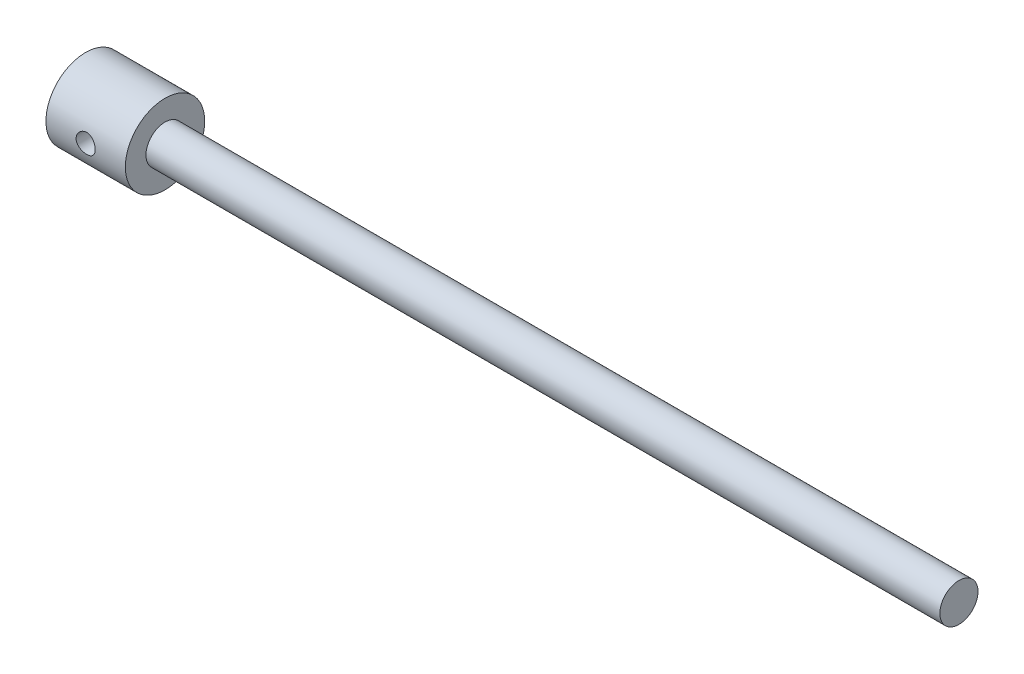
ISO-10303-21;
HEADER;
FILE_DESCRIPTION(('STEP AP214'),'2;1');
FILE_NAME('part.step','',(''),(''),'','','');
FILE_SCHEMA(('AUTOMOTIVE_DESIGN { 1 0 10303 214 1 1 1 1 }'));
ENDSEC;
DATA;
#1=APPLICATION_CONTEXT('core data for automotive mechanical design processes');
#2=APPLICATION_PROTOCOL_DEFINITION('international standard','automotive_design',2000,#1);
#3=PRODUCT_CONTEXT('',#1,'mechanical');
#4=PRODUCT('Part','Part','',(#3));
#5=PRODUCT_RELATED_PRODUCT_CATEGORY('part','',(#4));
#6=PRODUCT_DEFINITION_FORMATION('','',#4);
#7=PRODUCT_DEFINITION_CONTEXT('part definition',#1,'design');
#8=PRODUCT_DEFINITION('design','',#6,#7);
#9=PRODUCT_DEFINITION_SHAPE('','',#8);
#10=(LENGTH_UNIT() NAMED_UNIT(*) SI_UNIT(.MILLI.,.METRE.));
#11=(NAMED_UNIT(*) PLANE_ANGLE_UNIT() SI_UNIT($,.RADIAN.));
#12=(NAMED_UNIT(*) SI_UNIT($,.STERADIAN.) SOLID_ANGLE_UNIT());
#13=UNCERTAINTY_MEASURE_WITH_UNIT(LENGTH_MEASURE(1.E-05),#10,'distance_accuracy_value','');
#14=(GEOMETRIC_REPRESENTATION_CONTEXT(3) GLOBAL_UNCERTAINTY_ASSIGNED_CONTEXT((#13)) GLOBAL_UNIT_ASSIGNED_CONTEXT((#10,
#11,#12)) REPRESENTATION_CONTEXT('',''));
#15=CARTESIAN_POINT('',(0.,0.,0.));
#16=DIRECTION('',(0.,0.,1.));
#17=DIRECTION('',(1.,0.,0.));
#18=AXIS2_PLACEMENT_3D('',#15,#16,#17);
#19=CARTESIAN_POINT('',(50.,0.,0.));
#20=DIRECTION('',(-1.,0.,0.));
#21=DIRECTION('',(0.,0.,1.));
#22=AXIS2_PLACEMENT_3D('',#19,#20,#21);
#23=CYLINDRICAL_SURFACE('',#22,25.);
#24=CARTESIAN_POINT('',(31.,0.,-25.));
#25=CARTESIAN_POINT('',(31.0000045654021,0.166017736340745,-25.0000026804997));
#26=CARTESIAN_POINT('',(30.9931083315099,0.331984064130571,-24.9983437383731));
#27=CARTESIAN_POINT('',(30.9655909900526,0.662757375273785,-24.9917601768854));
#28=CARTESIAN_POINT('',(30.9449681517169,0.827564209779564,-24.9868351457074));
#29=CARTESIAN_POINT('',(30.8901535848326,1.15483168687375,-24.9738504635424));
#30=CARTESIAN_POINT('',(30.855957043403,1.31729147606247,-24.9657897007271));
#31=CARTESIAN_POINT('',(30.7742619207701,1.63872050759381,-24.9467537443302));
#32=CARTESIAN_POINT('',(30.7267584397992,1.79768844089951,-24.9357774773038));
#33=CARTESIAN_POINT('',(30.6189154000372,2.11072366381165,-24.9112316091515));
#34=CARTESIAN_POINT('',(30.5585957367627,2.26479812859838,-24.897666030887));
#35=CARTESIAN_POINT('',(30.4255126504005,2.56731972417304,-24.8682925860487));
#36=CARTESIAN_POINT('',(30.3527446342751,2.71576475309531,-24.8524838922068));
#37=CARTESIAN_POINT('',(30.1953429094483,3.00593509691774,-24.8190587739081));
#38=CARTESIAN_POINT('',(30.1107137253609,3.14766294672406,-24.8014430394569));
#39=CARTESIAN_POINT('',(29.930128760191,3.42359889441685,-24.7648612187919));
#40=CARTESIAN_POINT('',(29.8341687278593,3.55780414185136,-24.7458946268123));
#41=CARTESIAN_POINT('',(29.6298945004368,3.81996752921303,-24.7067947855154));
#42=CARTESIAN_POINT('',(29.5214001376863,3.94778319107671,-24.6866473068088));
#43=CARTESIAN_POINT('',(29.2940876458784,4.19391043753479,-24.6460277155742));
#44=CARTESIAN_POINT('',(29.1752657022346,4.31221847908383,-24.6255554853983));
#45=CARTESIAN_POINT('',(28.9281491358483,4.53846894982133,-24.5848634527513));
#46=CARTESIAN_POINT('',(28.7998569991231,4.64641408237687,-24.5646435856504));
#47=CARTESIAN_POINT('',(28.5345631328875,4.85128465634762,-24.5250062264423));
#48=CARTESIAN_POINT('',(28.3975582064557,4.94820601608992,-24.5055890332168));
#49=CARTESIAN_POINT('',(28.1139109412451,5.1315149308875,-24.4678652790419));
#50=CARTESIAN_POINT('',(27.9671650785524,5.21774615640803,-24.4495768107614));
#51=CARTESIAN_POINT('',(27.6666458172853,5.37754406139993,-24.4149279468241));
#52=CARTESIAN_POINT('',(27.5128697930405,5.45110595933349,-24.3985682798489));
#53=CARTESIAN_POINT('',(27.1994677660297,5.58492026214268,-24.3682865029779));
#54=CARTESIAN_POINT('',(27.0398446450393,5.64517912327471,-24.354363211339));
#55=CARTESIAN_POINT('',(26.7158528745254,5.75195806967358,-24.3293636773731));
#56=CARTESIAN_POINT('',(26.5514825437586,5.79847322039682,-24.318288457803));
#57=CARTESIAN_POINT('',(26.0591991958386,5.91523377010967,-24.2902598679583));
#58=CARTESIAN_POINT('',(25.7258747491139,5.96534620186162,-24.2778811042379));
#59=CARTESIAN_POINT('',(25.2235243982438,5.99819895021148,-24.2697663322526));
#60=CARTESIAN_POINT('',(25.055614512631,6.00209048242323,-24.2688053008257));
#61=CARTESIAN_POINT('',(24.7200533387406,5.99581246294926,-24.2703574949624));
#62=CARTESIAN_POINT('',(24.5524020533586,5.98564275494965,-24.2728707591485));
#63=CARTESIAN_POINT('',(24.0592354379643,5.93483975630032,-24.285368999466));
#64=CARTESIAN_POINT('',(23.7356610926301,5.87440247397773,-24.3001939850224));
#65=CARTESIAN_POINT('',(23.1035551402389,5.70184242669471,-24.3412549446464));
#66=CARTESIAN_POINT('',(22.7950245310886,5.58971623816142,-24.3674916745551));
#67=CARTESIAN_POINT('',(22.1981876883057,5.3158825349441,-24.4286958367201));
#68=CARTESIAN_POINT('',(21.9100987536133,5.15371899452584,-24.4637429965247));
#69=CARTESIAN_POINT('',(21.3647873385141,4.78473374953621,-24.5385748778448));
#70=CARTESIAN_POINT('',(21.1075698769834,4.57790479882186,-24.5783603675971));
#71=CARTESIAN_POINT('',(20.6242138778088,4.11902988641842,-24.6594640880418));
#72=CARTESIAN_POINT('',(20.3990660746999,3.86594129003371,-24.7007951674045));
#73=CARTESIAN_POINT('',(19.9942302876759,3.32511184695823,-24.7793903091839));
#74=CARTESIAN_POINT('',(19.8145434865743,3.03737009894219,-24.8166542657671));
#75=CARTESIAN_POINT('',(19.5054056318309,2.43405695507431,-24.8830789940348));
#76=CARTESIAN_POINT('',(19.3761051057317,2.11840557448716,-24.9122154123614));
#77=CARTESIAN_POINT('',(19.1726698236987,1.46899521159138,-24.9589240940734));
#78=CARTESIAN_POINT('',(19.0985253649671,1.13523942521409,-24.9764983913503));
#79=CARTESIAN_POINT('',(19.0089958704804,0.467574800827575,-24.9978055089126));
#80=CARTESIAN_POINT('',(18.9922601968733,0.133856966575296,-25.0018564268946));
#81=CARTESIAN_POINT('',(19.0143335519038,-0.531608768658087,-24.9965614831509));
#82=CARTESIAN_POINT('',(19.053137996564,-0.863356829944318,-24.9872167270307));
#83=CARTESIAN_POINT('',(19.1840738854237,-1.51084514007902,-24.9563832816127));
#84=CARTESIAN_POINT('',(19.2754779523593,-1.8267410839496,-24.9350603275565));
#85=CARTESIAN_POINT('',(19.5081966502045,-2.4387066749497,-24.8826669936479));
#86=CARTESIAN_POINT('',(19.6495160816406,-2.73477441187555,-24.8515956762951));
#87=CARTESIAN_POINT('',(19.9807321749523,-3.30412273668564,-24.7823820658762));
#88=CARTESIAN_POINT('',(20.171397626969,-3.57694246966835,-24.7441307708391));
#89=CARTESIAN_POINT('',(20.5949176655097,-4.08719914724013,-24.6649871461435));
#90=CARTESIAN_POINT('',(20.8277789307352,-4.32463047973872,-24.6240943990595));
#91=CARTESIAN_POINT('',(21.3352671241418,-4.76284500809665,-24.5431489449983));
#92=CARTESIAN_POINT('',(21.6107154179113,-4.96268414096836,-24.5031358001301));
#93=CARTESIAN_POINT('',(22.1922356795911,-5.31333575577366,-24.4295058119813));
#94=CARTESIAN_POINT('',(22.4983062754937,-5.46415043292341,-24.395888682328));
#95=CARTESIAN_POINT('',(22.9725936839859,-5.64963439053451,-24.353347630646));
#96=CARTESIAN_POINT('',(23.1328069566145,-5.70458710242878,-24.3405033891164));
#97=CARTESIAN_POINT('',(23.457482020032,-5.80079732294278,-24.3177552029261));
#98=CARTESIAN_POINT('',(23.6219421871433,-5.84205998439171,-24.3078501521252));
#99=CARTESIAN_POINT('',(23.9539179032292,-5.91053741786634,-24.2912903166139));
#100=CARTESIAN_POINT('',(24.1214335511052,-5.93775173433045,-24.2846356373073));
#101=CARTESIAN_POINT('',(24.4582664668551,-5.97789965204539,-24.2747841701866));
#102=CARTESIAN_POINT('',(24.6275836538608,-5.99083389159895,-24.2715872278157));
#103=CARTESIAN_POINT('',(24.9622487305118,-6.00215499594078,-24.2687899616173));
#104=CARTESIAN_POINT('',(25.1275832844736,-6.00091722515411,-24.2690968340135));
#105=CARTESIAN_POINT('',(25.4575435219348,-5.98480872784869,-24.2730742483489));
#106=CARTESIAN_POINT('',(25.6221692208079,-5.969938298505,-24.2767447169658));
#107=CARTESIAN_POINT('',(25.9495546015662,-5.92668661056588,-24.2873399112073));
#108=CARTESIAN_POINT('',(26.1123139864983,-5.89830323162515,-24.294265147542));
#109=CARTESIAN_POINT('',(26.4347302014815,-5.82827196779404,-24.3111608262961));
#110=CARTESIAN_POINT('',(26.59438810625,-5.78662876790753,-24.3211301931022));
#111=CARTESIAN_POINT('',(26.9088075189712,-5.69063662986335,-24.3437686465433));
#112=CARTESIAN_POINT('',(27.0635886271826,-5.63634876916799,-24.3564247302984));
#113=CARTESIAN_POINT('',(27.3679533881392,-5.51539707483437,-24.3840980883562));
#114=CARTESIAN_POINT('',(27.5175388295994,-5.44873755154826,-24.3991145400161));
#115=CARTESIAN_POINT('',(27.8106621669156,-5.30348427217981,-24.4310987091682));
#116=CARTESIAN_POINT('',(27.9541973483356,-5.22488523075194,-24.4480672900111));
#117=CARTESIAN_POINT('',(28.2341911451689,-5.05635243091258,-24.4834782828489));
#118=CARTESIAN_POINT('',(28.3706520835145,-4.96642242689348,-24.5019202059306));
#119=CARTESIAN_POINT('',(28.6389503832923,-4.77346921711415,-24.5402505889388));
#120=CARTESIAN_POINT('',(28.7705923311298,-4.67017903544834,-24.5601634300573));
#121=CARTESIAN_POINT('',(29.02470841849,-4.45304880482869,-24.600458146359));
#122=CARTESIAN_POINT('',(29.1471856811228,-4.33921237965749,-24.6208398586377));
#123=CARTESIAN_POINT('',(29.3822931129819,-4.10164015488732,-24.661530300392));
#124=CARTESIAN_POINT('',(29.4949174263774,-3.97789855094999,-24.6818389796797));
#125=CARTESIAN_POINT('',(29.7094481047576,-3.7214296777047,-24.7218081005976));
#126=CARTESIAN_POINT('',(29.8113583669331,-3.58870570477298,-24.7414687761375));
#127=CARTESIAN_POINT('',(30.0054239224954,-3.31280088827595,-24.7799327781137));
#128=CARTESIAN_POINT('',(30.0973872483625,-3.16948213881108,-24.7987162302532));
#129=CARTESIAN_POINT('',(30.2688530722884,-2.87543817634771,-24.8345280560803));
#130=CARTESIAN_POINT('',(30.3483601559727,-2.72471571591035,-24.8515570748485));
#131=CARTESIAN_POINT('',(30.4943122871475,-2.41692354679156,-24.883375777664));
#132=CARTESIAN_POINT('',(30.5607634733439,-2.25985686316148,-24.8981665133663));
#133=CARTESIAN_POINT('',(30.6801042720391,-1.94048744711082,-24.9250921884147));
#134=CARTESIAN_POINT('',(30.7329960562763,-1.77818555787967,-24.9372275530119));
#135=CARTESIAN_POINT('',(30.8520251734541,-1.35190448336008,-24.9647957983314));
#136=CARTESIAN_POINT('',(30.9074241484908,-1.08469226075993,-24.9779181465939));
#137=CARTESIAN_POINT('',(30.9814066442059,-0.544940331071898,-24.9955177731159));
#138=CARTESIAN_POINT('',(30.9999925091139,-0.272400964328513,-24.9999956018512));
#139=CARTESIAN_POINT('',(31.,0.,-25.));
#140=B_SPLINE_CURVE_WITH_KNOTS('',3,(#24,#25,#26,#27,#28,#29,#30,#31,#32,#33,#34,#35,#36,#37,
#38,#39,#40,#41,#42,#43,#44,#45,#46,#47,#48,#49,#50,#51,#52,#53,#54,#55,#56,#57,#58,#59,#60,#61,
#62,#63,#64,#65,#66,#67,#68,#69,#70,#71,#72,#73,#74,#75,#76,#77,#78,#79,#80,#81,#82,#83,#84,#85,
#86,#87,#88,#89,#90,#91,#92,#93,#94,#95,#96,#97,#98,#99,#100,#101,#102,#103,#104,#105,#106,#107,
#108,#109,#110,#111,#112,#113,#114,#115,#116,#117,#118,#119,#120,#121,#122,#123,#124,#125,#126,
#127,#128,#129,#130,#131,#132,#133,#134,#135,#136,#137,#138,#139),.UNSPECIFIED.,.T.,.F.,(4,2,2,
2,2,2,2,2,2,2,2,2,2,2,2,2,2,2,2,2,2,2,2,2,2,2,2,2,2,2,2,2,2,2,2,2,2,2,2,2,2,2,2,2,2,2,2,2,2,2,2,
2,2,2,2,2,2,4),(0.,0.497813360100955,0.995689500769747,1.49374233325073,1.99197879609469,
2.4894473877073,2.98709992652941,3.48456314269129,3.98221359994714,4.48820831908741,
4.99439073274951,5.50044073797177,6.00667750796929,6.51961190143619,7.03273945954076,
7.54561743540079,8.05867933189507,9.06463756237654,9.56800871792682,10.0713854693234,
11.0548629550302,12.0384055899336,13.0311908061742,14.0241372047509,15.0430966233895,
16.0620825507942,17.0840897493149,18.1059171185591,19.1035329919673,20.1010665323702,
21.085126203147,22.069280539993,23.0698021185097,24.0704821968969,25.0936623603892,
26.1167967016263,26.6258643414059,27.1347401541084,27.6436324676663,28.1525020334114,
28.6479253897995,29.1433379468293,29.6388282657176,30.1341437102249,30.6271145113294,
31.1199138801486,31.6129320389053,32.105787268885,32.6107272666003,33.1154944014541,
33.6205595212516,34.1254402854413,34.6387770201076,35.1519243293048,35.6648297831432,
36.1776530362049,36.9945144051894,37.8113237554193),.UNSPECIFIED.);
#141=CARTESIAN_POINT('',(31.,0.,-25.));
#142=VERTEX_POINT('',#141);
#143=EDGE_CURVE('E43',#142,#142,#140,.T.);
#144=ORIENTED_EDGE('',*,*,#143,.T.);
#145=EDGE_LOOP('',(#144));
#146=FACE_BOUND('',#145,.T.);
#147=CARTESIAN_POINT('',(31.,0.,25.));
#148=CARTESIAN_POINT('',(31.0000045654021,-0.166017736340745,25.0000026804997));
#149=CARTESIAN_POINT('',(30.9931083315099,-0.331984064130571,24.9983437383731));
#150=CARTESIAN_POINT('',(30.9655909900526,-0.662757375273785,24.9917601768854));
#151=CARTESIAN_POINT('',(30.9449681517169,-0.827564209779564,24.9868351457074));
#152=CARTESIAN_POINT('',(30.8901535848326,-1.15483168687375,24.9738504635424));
#153=CARTESIAN_POINT('',(30.855957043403,-1.31729147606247,24.9657897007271));
#154=CARTESIAN_POINT('',(30.7742619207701,-1.63872050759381,24.9467537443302));
#155=CARTESIAN_POINT('',(30.7267584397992,-1.79768844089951,24.9357774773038));
#156=CARTESIAN_POINT('',(30.6189154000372,-2.11072366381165,24.9112316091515));
#157=CARTESIAN_POINT('',(30.5585957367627,-2.26479812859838,24.897666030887));
#158=CARTESIAN_POINT('',(30.4255126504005,-2.56731972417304,24.8682925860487));
#159=CARTESIAN_POINT('',(30.3527446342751,-2.71576475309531,24.8524838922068));
#160=CARTESIAN_POINT('',(30.1953429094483,-3.00593509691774,24.8190587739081));
#161=CARTESIAN_POINT('',(30.1107137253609,-3.14766294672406,24.8014430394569));
#162=CARTESIAN_POINT('',(29.930128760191,-3.42359889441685,24.7648612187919));
#163=CARTESIAN_POINT('',(29.8341687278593,-3.55780414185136,24.7458946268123));
#164=CARTESIAN_POINT('',(29.6298945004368,-3.81996752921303,24.7067947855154));
#165=CARTESIAN_POINT('',(29.5214001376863,-3.94778319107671,24.6866473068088));
#166=CARTESIAN_POINT('',(29.2940876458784,-4.19391043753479,24.6460277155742));
#167=CARTESIAN_POINT('',(29.1752657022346,-4.31221847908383,24.6255554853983));
#168=CARTESIAN_POINT('',(28.9281491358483,-4.53846894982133,24.5848634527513));
#169=CARTESIAN_POINT('',(28.7998569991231,-4.64641408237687,24.5646435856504));
#170=CARTESIAN_POINT('',(28.5345631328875,-4.85128465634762,24.5250062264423));
#171=CARTESIAN_POINT('',(28.3975582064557,-4.94820601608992,24.5055890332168));
#172=CARTESIAN_POINT('',(28.1139109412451,-5.1315149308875,24.4678652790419));
#173=CARTESIAN_POINT('',(27.9671650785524,-5.21774615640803,24.4495768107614));
#174=CARTESIAN_POINT('',(27.6666458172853,-5.37754406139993,24.4149279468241));
#175=CARTESIAN_POINT('',(27.5128697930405,-5.45110595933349,24.3985682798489));
#176=CARTESIAN_POINT('',(27.1994677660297,-5.58492026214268,24.3682865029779));
#177=CARTESIAN_POINT('',(27.0398446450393,-5.64517912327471,24.354363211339));
#178=CARTESIAN_POINT('',(26.7158528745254,-5.75195806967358,24.3293636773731));
#179=CARTESIAN_POINT('',(26.5514825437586,-5.79847322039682,24.318288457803));
#180=CARTESIAN_POINT('',(26.0591991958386,-5.91523377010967,24.2902598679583));
#181=CARTESIAN_POINT('',(25.7258747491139,-5.96534620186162,24.2778811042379));
#182=CARTESIAN_POINT('',(25.2235243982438,-5.99819895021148,24.2697663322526));
#183=CARTESIAN_POINT('',(25.055614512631,-6.00209048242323,24.2688053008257));
#184=CARTESIAN_POINT('',(24.7200533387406,-5.99581246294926,24.2703574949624));
#185=CARTESIAN_POINT('',(24.5524020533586,-5.98564275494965,24.2728707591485));
#186=CARTESIAN_POINT('',(24.0592354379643,-5.93483975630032,24.285368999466));
#187=CARTESIAN_POINT('',(23.7356610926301,-5.87440247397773,24.3001939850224));
#188=CARTESIAN_POINT('',(23.1035551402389,-5.70184242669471,24.3412549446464));
#189=CARTESIAN_POINT('',(22.7950245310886,-5.58971623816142,24.3674916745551));
#190=CARTESIAN_POINT('',(22.1981876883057,-5.3158825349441,24.4286958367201));
#191=CARTESIAN_POINT('',(21.9100987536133,-5.15371899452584,24.4637429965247));
#192=CARTESIAN_POINT('',(21.3647873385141,-4.78473374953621,24.5385748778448));
#193=CARTESIAN_POINT('',(21.1075698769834,-4.57790479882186,24.5783603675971));
#194=CARTESIAN_POINT('',(20.6242138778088,-4.11902988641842,24.6594640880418));
#195=CARTESIAN_POINT('',(20.3990660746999,-3.86594129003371,24.7007951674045));
#196=CARTESIAN_POINT('',(19.9942302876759,-3.32511184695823,24.7793903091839));
#197=CARTESIAN_POINT('',(19.8145434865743,-3.03737009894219,24.8166542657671));
#198=CARTESIAN_POINT('',(19.5054056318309,-2.43405695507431,24.8830789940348));
#199=CARTESIAN_POINT('',(19.3761051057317,-2.11840557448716,24.9122154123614));
#200=CARTESIAN_POINT('',(19.1726698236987,-1.46899521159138,24.9589240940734));
#201=CARTESIAN_POINT('',(19.0985253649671,-1.13523942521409,24.9764983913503));
#202=CARTESIAN_POINT('',(19.0089958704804,-0.467574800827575,24.9978055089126));
#203=CARTESIAN_POINT('',(18.9922601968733,-0.133856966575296,25.0018564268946));
#204=CARTESIAN_POINT('',(19.0143335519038,0.531608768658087,24.9965614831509));
#205=CARTESIAN_POINT('',(19.053137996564,0.863356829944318,24.9872167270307));
#206=CARTESIAN_POINT('',(19.1840738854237,1.51084514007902,24.9563832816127));
#207=CARTESIAN_POINT('',(19.2754779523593,1.8267410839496,24.9350603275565));
#208=CARTESIAN_POINT('',(19.5081966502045,2.4387066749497,24.8826669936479));
#209=CARTESIAN_POINT('',(19.6495160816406,2.73477441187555,24.8515956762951));
#210=CARTESIAN_POINT('',(19.9807321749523,3.30412273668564,24.7823820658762));
#211=CARTESIAN_POINT('',(20.171397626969,3.57694246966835,24.7441307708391));
#212=CARTESIAN_POINT('',(20.5949176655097,4.08719914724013,24.6649871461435));
#213=CARTESIAN_POINT('',(20.8277789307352,4.32463047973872,24.6240943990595));
#214=CARTESIAN_POINT('',(21.3352671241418,4.76284500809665,24.5431489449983));
#215=CARTESIAN_POINT('',(21.6107154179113,4.96268414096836,24.5031358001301));
#216=CARTESIAN_POINT('',(22.1922356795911,5.31333575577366,24.4295058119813));
#217=CARTESIAN_POINT('',(22.4983062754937,5.46415043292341,24.395888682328));
#218=CARTESIAN_POINT('',(22.9725936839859,5.64963439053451,24.353347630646));
#219=CARTESIAN_POINT('',(23.1328069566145,5.70458710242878,24.3405033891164));
#220=CARTESIAN_POINT('',(23.457482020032,5.80079732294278,24.3177552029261));
#221=CARTESIAN_POINT('',(23.6219421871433,5.84205998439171,24.3078501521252));
#222=CARTESIAN_POINT('',(23.9539179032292,5.91053741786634,24.2912903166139));
#223=CARTESIAN_POINT('',(24.1214335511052,5.93775173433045,24.2846356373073));
#224=CARTESIAN_POINT('',(24.4582664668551,5.97789965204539,24.2747841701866));
#225=CARTESIAN_POINT('',(24.6275836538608,5.99083389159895,24.2715872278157));
#226=CARTESIAN_POINT('',(24.9622487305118,6.00215499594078,24.2687899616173));
#227=CARTESIAN_POINT('',(25.1275832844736,6.00091722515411,24.2690968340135));
#228=CARTESIAN_POINT('',(25.4575435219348,5.98480872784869,24.2730742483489));
#229=CARTESIAN_POINT('',(25.6221692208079,5.969938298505,24.2767447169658));
#230=CARTESIAN_POINT('',(25.9495546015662,5.92668661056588,24.2873399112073));
#231=CARTESIAN_POINT('',(26.1123139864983,5.89830323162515,24.294265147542));
#232=CARTESIAN_POINT('',(26.4347302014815,5.82827196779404,24.3111608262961));
#233=CARTESIAN_POINT('',(26.59438810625,5.78662876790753,24.3211301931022));
#234=CARTESIAN_POINT('',(26.9088075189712,5.69063662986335,24.3437686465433));
#235=CARTESIAN_POINT('',(27.0635886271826,5.63634876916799,24.3564247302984));
#236=CARTESIAN_POINT('',(27.3679533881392,5.51539707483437,24.3840980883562));
#237=CARTESIAN_POINT('',(27.5175388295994,5.44873755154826,24.3991145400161));
#238=CARTESIAN_POINT('',(27.8106621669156,5.30348427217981,24.4310987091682));
#239=CARTESIAN_POINT('',(27.9541973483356,5.22488523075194,24.4480672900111));
#240=CARTESIAN_POINT('',(28.2341911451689,5.05635243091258,24.4834782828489));
#241=CARTESIAN_POINT('',(28.3706520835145,4.96642242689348,24.5019202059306));
#242=CARTESIAN_POINT('',(28.6389503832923,4.77346921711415,24.5402505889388));
#243=CARTESIAN_POINT('',(28.7705923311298,4.67017903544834,24.5601634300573));
#244=CARTESIAN_POINT('',(29.02470841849,4.45304880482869,24.600458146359));
#245=CARTESIAN_POINT('',(29.1471856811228,4.33921237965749,24.6208398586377));
#246=CARTESIAN_POINT('',(29.3822931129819,4.10164015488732,24.661530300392));
#247=CARTESIAN_POINT('',(29.4949174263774,3.97789855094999,24.6818389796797));
#248=CARTESIAN_POINT('',(29.7094481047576,3.7214296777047,24.7218081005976));
#249=CARTESIAN_POINT('',(29.8113583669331,3.58870570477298,24.7414687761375));
#250=CARTESIAN_POINT('',(30.0054239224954,3.31280088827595,24.7799327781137));
#251=CARTESIAN_POINT('',(30.0973872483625,3.16948213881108,24.7987162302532));
#252=CARTESIAN_POINT('',(30.2688530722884,2.87543817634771,24.8345280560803));
#253=CARTESIAN_POINT('',(30.3483601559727,2.72471571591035,24.8515570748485));
#254=CARTESIAN_POINT('',(30.4943122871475,2.41692354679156,24.883375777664));
#255=CARTESIAN_POINT('',(30.5607634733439,2.25985686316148,24.8981665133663));
#256=CARTESIAN_POINT('',(30.6801042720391,1.94048744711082,24.9250921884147));
#257=CARTESIAN_POINT('',(30.7329960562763,1.77818555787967,24.9372275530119));
#258=CARTESIAN_POINT('',(30.8520251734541,1.35190448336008,24.9647957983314));
#259=CARTESIAN_POINT('',(30.9074241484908,1.08469226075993,24.9779181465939));
#260=CARTESIAN_POINT('',(30.9814066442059,0.544940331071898,24.9955177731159));
#261=CARTESIAN_POINT('',(30.9999925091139,0.272400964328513,24.9999956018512));
#262=CARTESIAN_POINT('',(31.,0.,25.));
#263=B_SPLINE_CURVE_WITH_KNOTS('',3,(#147,#148,#149,#150,#151,#152,#153,#154,#155,#156,#157,
#158,#159,#160,#161,#162,#163,#164,#165,#166,#167,#168,#169,#170,#171,#172,#173,#174,#175,#176,
#177,#178,#179,#180,#181,#182,#183,#184,#185,#186,#187,#188,#189,#190,#191,#192,#193,#194,#195,
#196,#197,#198,#199,#200,#201,#202,#203,#204,#205,#206,#207,#208,#209,#210,#211,#212,#213,#214,
#215,#216,#217,#218,#219,#220,#221,#222,#223,#224,#225,#226,#227,#228,#229,#230,#231,#232,#233,
#234,#235,#236,#237,#238,#239,#240,#241,#242,#243,#244,#245,#246,#247,#248,#249,#250,#251,#252,
#253,#254,#255,#256,#257,#258,#259,#260,#261,#262),.UNSPECIFIED.,.T.,.F.,(4,2,2,2,2,2,2,2,2,2,2,
2,2,2,2,2,2,2,2,2,2,2,2,2,2,2,2,2,2,2,2,2,2,2,2,2,2,2,2,2,2,2,2,2,2,2,2,2,2,2,2,2,2,2,2,2,2,4),
(0.,0.497813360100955,0.995689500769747,1.49374233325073,1.99197879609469,2.4894473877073,
2.98709992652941,3.48456314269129,3.98221359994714,4.48820831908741,4.99439073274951,
5.50044073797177,6.00667750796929,6.51961190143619,7.03273945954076,7.54561743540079,
8.05867933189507,9.06463756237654,9.56800871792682,10.0713854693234,11.0548629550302,
12.0384055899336,13.0311908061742,14.0241372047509,15.0430966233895,16.0620825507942,
17.0840897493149,18.1059171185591,19.1035329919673,20.1010665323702,21.085126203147,
22.069280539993,23.0698021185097,24.0704821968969,25.0936623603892,26.1167967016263,
26.6258643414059,27.1347401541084,27.6436324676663,28.1525020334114,28.6479253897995,
29.1433379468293,29.6388282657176,30.1341437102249,30.6271145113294,31.1199138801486,
31.6129320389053,32.105787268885,32.6107272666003,33.1154944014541,33.6205595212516,
34.1254402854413,34.6387770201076,35.1519243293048,35.6648297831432,36.1776530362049,
36.9945144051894,37.8113237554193),.UNSPECIFIED.);
#264=CARTESIAN_POINT('',(31.,0.,25.));
#265=VERTEX_POINT('',#264);
#266=EDGE_CURVE('E55',#265,#265,#263,.T.);
#267=ORIENTED_EDGE('',*,*,#266,.T.);
#268=EDGE_LOOP('',(#267));
#269=FACE_BOUND('',#268,.T.);
#270=CARTESIAN_POINT('',(50.,0.,0.));
#271=DIRECTION('',(1.,0.,0.));
#272=DIRECTION('',(0.,0.,-1.));
#273=AXIS2_PLACEMENT_3D('',#270,#271,#272);
#274=CIRCLE('',#273,25.);
#275=CARTESIAN_POINT('',(50.,0.,-25.));
#276=VERTEX_POINT('',#275);
#277=EDGE_CURVE('E59',#276,#276,#274,.T.);
#278=ORIENTED_EDGE('',*,*,#277,.F.);
#279=EDGE_LOOP('',(#278));
#280=FACE_BOUND('',#279,.T.);
#281=CARTESIAN_POINT('',(0.,0.,0.));
#282=DIRECTION('',(1.,0.,0.));
#283=DIRECTION('',(0.,0.,-1.));
#284=AXIS2_PLACEMENT_3D('',#281,#282,#283);
#285=CIRCLE('',#284,25.);
#286=CARTESIAN_POINT('',(0.,0.,-25.));
#287=VERTEX_POINT('',#286);
#288=EDGE_CURVE('E62',#287,#287,#285,.T.);
#289=ORIENTED_EDGE('',*,*,#288,.T.);
#290=EDGE_LOOP('',(#289));
#291=FACE_BOUND('',#290,.T.);
#292=ADVANCED_FACE('F39',(#146,#269,#280,#291),#23,.T.);
#293=CARTESIAN_POINT('',(50.,0.,0.));
#294=DIRECTION('',(1.,0.,0.));
#295=DIRECTION('',(0.,0.,-1.));
#296=AXIS2_PLACEMENT_3D('',#293,#294,#295);
#297=PLANE('',#296);
#298=CARTESIAN_POINT('',(50.,0.,0.));
#299=DIRECTION('',(1.,0.,0.));
#300=DIRECTION('',(0.,0.,-1.));
#301=AXIS2_PLACEMENT_3D('',#298,#299,#300);
#302=CIRCLE('',#301,12.);
#303=CARTESIAN_POINT('',(50.,0.,-12.));
#304=VERTEX_POINT('',#303);
#305=EDGE_CURVE('E10',#304,#304,#302,.T.);
#306=ORIENTED_EDGE('',*,*,#305,.F.);
#307=EDGE_LOOP('',(#306));
#308=FACE_BOUND('',#307,.T.);
#309=ORIENTED_EDGE('',*,*,#277,.T.);
#310=EDGE_LOOP('',(#309));
#311=FACE_BOUND('',#310,.T.);
#312=ADVANCED_FACE('F77',(#308,#311),#297,.T.);
#313=CARTESIAN_POINT('',(0.,0.,0.));
#314=DIRECTION('',(1.,0.,0.));
#315=DIRECTION('',(0.,0.,-1.));
#316=AXIS2_PLACEMENT_3D('',#313,#314,#315);
#317=PLANE('',#316);
#318=ORIENTED_EDGE('',*,*,#288,.F.);
#319=EDGE_LOOP('',(#318));
#320=FACE_BOUND('',#319,.T.);
#321=ADVANCED_FACE('F74',(#320),#317,.F.);
#322=CARTESIAN_POINT('',(25.,0.,-25.));
#323=DIRECTION('',(0.,0.,1.));
#324=DIRECTION('',(1.,0.,0.));
#325=AXIS2_PLACEMENT_3D('',#322,#323,#324);
#326=CYLINDRICAL_SURFACE('',#325,6.);
#327=ORIENTED_EDGE('',*,*,#266,.F.);
#328=EDGE_LOOP('',(#327));
#329=FACE_BOUND('',#328,.T.);
#330=ORIENTED_EDGE('',*,*,#143,.F.);
#331=EDGE_LOOP('',(#330));
#332=FACE_BOUND('',#331,.T.);
#333=ADVANCED_FACE('F68',(#329,#332),#326,.F.);
#334=CARTESIAN_POINT('',(550.,0.,0.));
#335=DIRECTION('',(-1.,0.,0.));
#336=DIRECTION('',(0.,0.,1.));
#337=AXIS2_PLACEMENT_3D('',#334,#335,#336);
#338=CYLINDRICAL_SURFACE('',#337,12.);
#339=CARTESIAN_POINT('',(550.,0.,0.));
#340=DIRECTION('',(1.,0.,0.));
#341=DIRECTION('',(0.,0.,-1.));
#342=AXIS2_PLACEMENT_3D('',#339,#340,#341);
#343=CIRCLE('',#342,12.);
#344=CARTESIAN_POINT('',(550.,0.,-12.));
#345=VERTEX_POINT('',#344);
#346=EDGE_CURVE('E58',#345,#345,#343,.T.);
#347=ORIENTED_EDGE('',*,*,#346,.F.);
#348=EDGE_LOOP('',(#347));
#349=FACE_BOUND('',#348,.T.);
#350=ORIENTED_EDGE('',*,*,#305,.T.);
#351=EDGE_LOOP('',(#350));
#352=FACE_BOUND('',#351,.T.);
#353=ADVANCED_FACE('F73',(#349,#352),#338,.T.);
#354=CARTESIAN_POINT('',(550.,0.,0.));
#355=DIRECTION('',(1.,0.,0.));
#356=DIRECTION('',(0.,0.,-1.));
#357=AXIS2_PLACEMENT_3D('',#354,#355,#356);
#358=PLANE('',#357);
#359=ORIENTED_EDGE('',*,*,#346,.T.);
#360=EDGE_LOOP('',(#359));
#361=FACE_BOUND('',#360,.T.);
#362=ADVANCED_FACE('F112',(#361),#358,.T.);
#363=CLOSED_SHELL('',(#292,#312,#321,#333,#353,#362));
#364=MANIFOLD_SOLID_BREP('B2',#363);
#365=ADVANCED_BREP_SHAPE_REPRESENTATION('',(#18,#364),#14);
#366=SHAPE_DEFINITION_REPRESENTATION(#9,#365);
ENDSEC;
END-ISO-10303-21;
